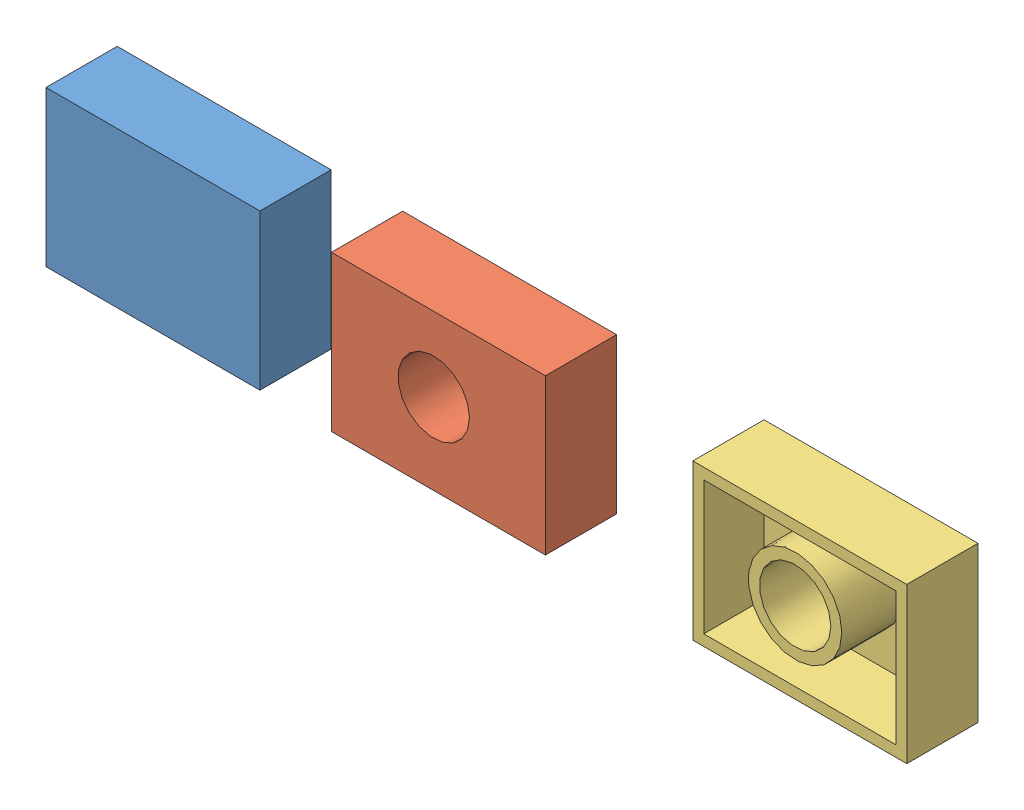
SolidWorks assembly Quote1234Assembly1.SLDASM, configuration Default (file format 5800). Lengths in mm.
Overall size (199.48 35.98 16.51).
3 component instances, 3 part files, 6 mates.
Components (placement in the parent):
- Part1-1: Part1.SLDPRT [Default] at origin size (49.58 35.98 16.51)
- Part2-1: Part2.SLDPRT [Default] at (66.1539 0 0) size (49.58 35.98 16.51)
- Part3-1: Part3.SLDPRT [Default] at (149.9029 0 0) size (49.58 35.98 16.51)
Mates (geometry in assembly coordinates):
- Coincident1: coincident aligned: plane of Part1-1 through (0 35.978 16.51) normal (0 1 0); plane of Part2-1 through (66.1539 35.978 16.51) normal (0 1 0)
- Coincident2: coincident aligned: plane of Part1-1 through (0 35.978 16.51) normal (0 0 1); plane of Part2-1 through (66.1539 35.978 16.51) normal (0 0 1)
- Distance1: distance = 16.5729 mm anti-aligned: plane of Part1-1 through (49.581 0 16.51) normal (1 0 0); plane of Part2-1 through (66.1539 0 16.51) normal (-1 0 0)
- Coincident4: coincident aligned: plane of Part2-1 through (66.1539 35.978 16.51) normal (0 0 1); plane of Part3-1 through (149.9029 35.978 16.51) normal (0 0 1)
- Coincident5: coincident aligned: plane of Part2-1 through (66.1539 35.978 16.51) normal (0 1 0); plane of Part3-1 through (149.9029 35.978 16.51) normal (0 1 0)
- Distance2: distance = 34.168 mm anti-aligned: plane of Part2-1 through (115.7349 0 16.51) normal (1 0 0); plane of Part3-1 through (149.9029 0 16.51) normal (-1 0 0)
